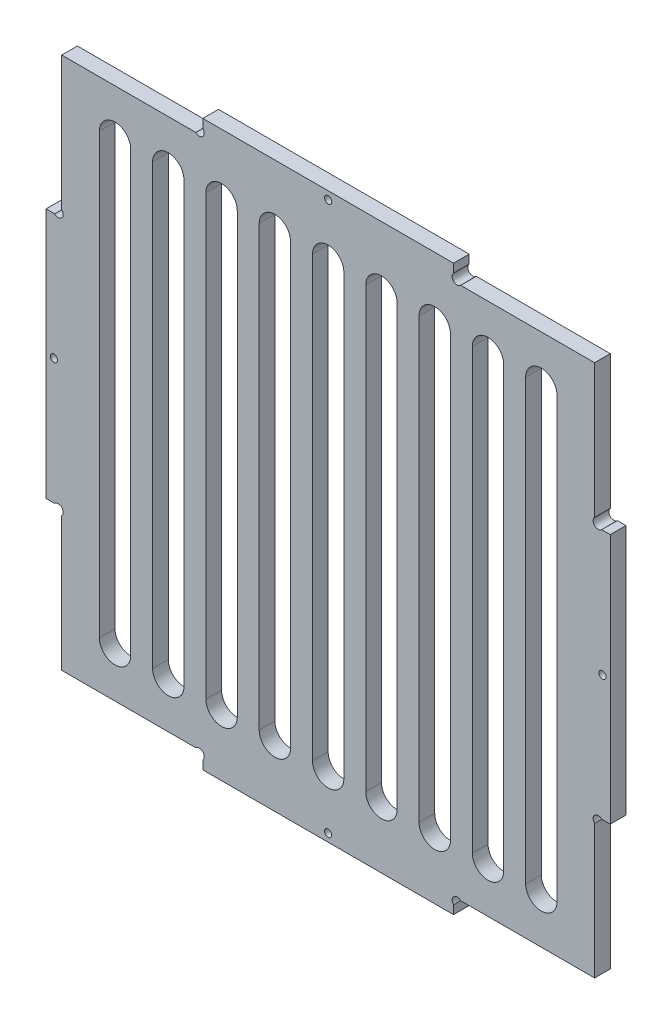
from build123d import *

# Parameters (mm, degrees)
ESQUISSE1_W                    = 180
ESQUISSE1_H                    = 180
BOSS_EXTRU_1_DEPTH             = 5
ENL_V_MAT_EXTRU_1_DEPTH        = 255.607541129
ESQUISSE4_R                    = 1.6
ENL_V_MAT_EXTRU_3_DEPTH        = 255.607541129
ESQUISSE5_R                    = 1.15
ENL_V_MAT_EXTRU_4_DEPTH        = 255.607541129
ENL_V_MAT_EXTRU_5_DEPTH        = 255.607541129
R_P_TITION_LIN_AIRE1_COUNT     = 5
R_P_TITION_LIN_AIRE1_PITCH     = 17
R_P_TITION_LIN_AIRE1_COL_COUNT = 5
R_P_TITION_LIN_AIRE1_COL_PITCH = 17


with BuildPart() as part:
    # Esquisse1 → Boss.-Extru.1 (new body)
    with BuildSketch(Plane.XY):
        with Locations((90, 90)):
            Rectangle(ESQUISSE1_W, ESQUISSE1_H)
    extrude(amount=BOSS_EXTRU_1_DEPTH)

    # Esquisse2 → Enl_v. mat.-Extru.1 (cut, through all)
    with BuildSketch(Plane(origin=(0, 0, 0), x_dir=(-1, 0, 0), z_dir=(0, 0, -1))):
        Polygon((-180, 130), (-175, 130), (-175, 175), (-130, 175), (-130, 180), (-180, 180), align=None)
        Polygon((-180, 50), (-175, 50), (-175, 5), (-130, 5), (-130, 0), (-180, 0), align=None)
        Polygon((-50, 180), (0, 180), (0, 130), (-5, 130), (-5, 175), (-50, 175), align=None)
        Polygon((-50, 0), (-50, 5), (-5, 5), (-5, 50), (0, 50), (0, 0), align=None)
    extrude(amount=-ENL_V_MAT_EXTRU_1_DEPTH, mode=Mode.SUBTRACT)

    # Esquisse4 → Enl_v. mat.-Extru.3 (cut, through all)
    with BuildSketch(Plane(origin=(0, 0, 0), x_dir=(-1, 0, 0), z_dir=(0, 0, -1))):
        with Locations((-131.13137085, 176.13137085)):
            Circle(ESQUISSE4_R)
        with Locations((-48.86862915, 176.13137085)):
            Circle(ESQUISSE4_R)
        with Locations((-3.86862915, 131.13137085)):
            Circle(ESQUISSE4_R)
        with Locations((-3.86862915, 48.86862915)):
            Circle(ESQUISSE4_R)
        with Locations((-48.86862915, 3.86862915)):
            Circle(ESQUISSE4_R)
        with Locations((-131.13137085, 3.86862915)):
            Circle(ESQUISSE4_R)
        with Locations((-176.13137085, 48.86862915)):
            Circle(ESQUISSE4_R)
        with Locations((-176.13137085, 131.13137085)):
            Circle(ESQUISSE4_R)
    extrude(amount=-ENL_V_MAT_EXTRU_3_DEPTH, mode=Mode.SUBTRACT)

    # Esquisse5 → Enl_v. mat.-Extru.4 (cut, through all)
    with BuildSketch(Plane(origin=(0, 0, 0), x_dir=(-1, 0, 0), z_dir=(0, 0, -1))):
        with Locations((-90, 177.5)):
            Circle(ESQUISSE5_R)
        with Locations(Location((-2.5, 90, 0), (0, 0, 180))):
            Circle(ESQUISSE5_R)
        with Locations((-90, 2.5)):
            Circle(ESQUISSE5_R)
        with Locations(Location((-177.5, 90, 0), (0, 0, 180))):
            Circle(ESQUISSE5_R)
    extrude(amount=-ENL_V_MAT_EXTRU_4_DEPTH, mode=Mode.SUBTRACT)

    # Esquisse6 → Enl_v. mat.-Extru.5 (cut, through all)
    with BuildSketch(Plane(origin=(0, 0, 0), x_dir=(-1, 0, 0), z_dir=(0, 0, -1))):
        with BuildLine():
            Line((-85, 160), (-85, 20))
            ThreePointArc((-85, 20), (-90, 15), (-95, 20))
            Line((-95, 20), (-95, 160))
            ThreePointArc((-95, 160), (-90, 165), (-85, 160))
        make_face()
    enl_v_mat_extru_5 = extrude(amount=-ENL_V_MAT_EXTRU_5_DEPTH, mode=Mode.SUBTRACT)

    # R_p_tition lin_aire1: Enl_v. mat.-Extru.5 ×5
    with Locations(*[(i * R_P_TITION_LIN_AIRE1_PITCH, 0, 0) for i in range(1, R_P_TITION_LIN_AIRE1_COUNT)]):
        add(enl_v_mat_extru_5, mode=Mode.SUBTRACT)

    # R_p_tition lin_aire1 col: Enl_v. mat.-Extru.5 ×5
    with Locations(*[(-i * R_P_TITION_LIN_AIRE1_COL_PITCH, 0, 0) for i in range(1, R_P_TITION_LIN_AIRE1_COL_COUNT)]):
        add(enl_v_mat_extru_5, mode=Mode.SUBTRACT)


solid = part.part
